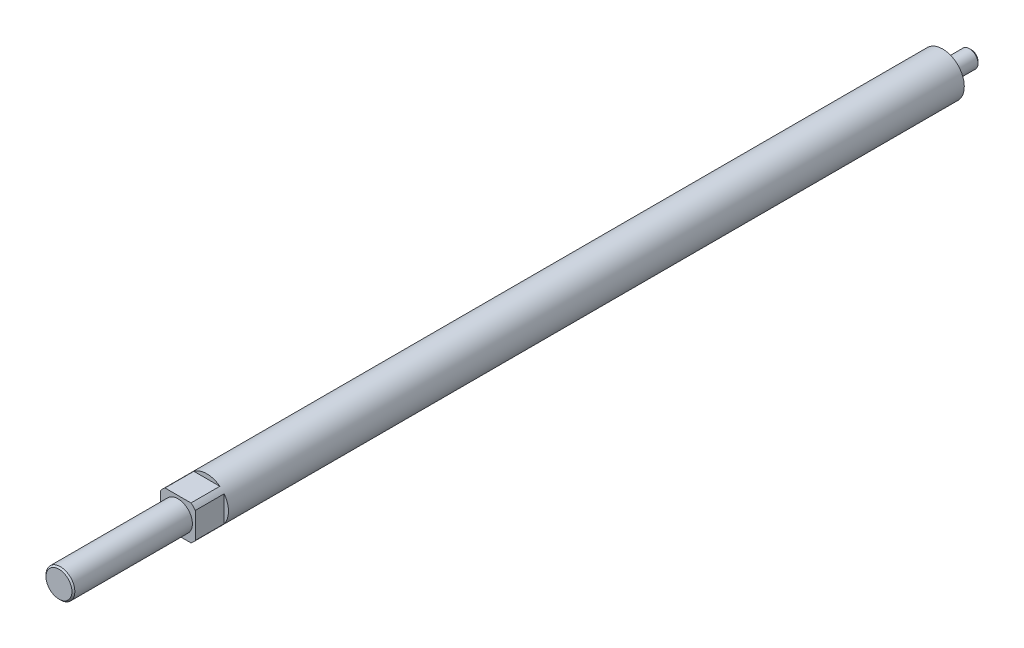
ISO-10303-21;
HEADER;
FILE_DESCRIPTION(('STEP AP214'),'2;1');
FILE_NAME('part.step','',(''),(''),'','','');
FILE_SCHEMA(('AUTOMOTIVE_DESIGN { 1 0 10303 214 1 1 1 1 }'));
ENDSEC;
DATA;
#1=APPLICATION_CONTEXT('core data for automotive mechanical design processes');
#2=APPLICATION_PROTOCOL_DEFINITION('international standard','automotive_design',2000,#1);
#3=PRODUCT_CONTEXT('',#1,'mechanical');
#4=PRODUCT('Part','Part','',(#3));
#5=PRODUCT_RELATED_PRODUCT_CATEGORY('part','',(#4));
#6=PRODUCT_DEFINITION_FORMATION('','',#4);
#7=PRODUCT_DEFINITION_CONTEXT('part definition',#1,'design');
#8=PRODUCT_DEFINITION('design','',#6,#7);
#9=PRODUCT_DEFINITION_SHAPE('','',#8);
#10=(LENGTH_UNIT() NAMED_UNIT(*) SI_UNIT(.MILLI.,.METRE.));
#11=(NAMED_UNIT(*) PLANE_ANGLE_UNIT() SI_UNIT($,.RADIAN.));
#12=(NAMED_UNIT(*) SI_UNIT($,.STERADIAN.) SOLID_ANGLE_UNIT());
#13=UNCERTAINTY_MEASURE_WITH_UNIT(LENGTH_MEASURE(1.E-05),#10,'distance_accuracy_value','');
#14=(GEOMETRIC_REPRESENTATION_CONTEXT(3) GLOBAL_UNCERTAINTY_ASSIGNED_CONTEXT((#13)) GLOBAL_UNIT_ASSIGNED_CONTEXT((#10,
#11,#12)) REPRESENTATION_CONTEXT('',''));
#15=CARTESIAN_POINT('',(0.,0.,0.));
#16=DIRECTION('',(0.,0.,1.));
#17=DIRECTION('',(1.,0.,0.));
#18=AXIS2_PLACEMENT_3D('',#15,#16,#17);
#19=CARTESIAN_POINT('',(0.,5.,-177.));
#20=DIRECTION('',(0.,0.,1.));
#21=DIRECTION('',(1.,0.,0.));
#22=AXIS2_PLACEMENT_3D('',#19,#20,#21);
#23=PLANE('',#22);
#24=CARTESIAN_POINT('',(0.,0.,-177.));
#25=DIRECTION('',(0.,0.,1.));
#26=DIRECTION('',(1.,0.,0.));
#27=AXIS2_PLACEMENT_3D('',#24,#25,#26);
#28=CIRCLE('',#27,15.0000000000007);
#29=CARTESIAN_POINT('',(15.0000000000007,0.,-177.));
#30=VERTEX_POINT('',#29);
#31=EDGE_CURVE('E176',#30,#30,#28,.T.);
#32=ORIENTED_EDGE('',*,*,#31,.F.);
#33=EDGE_LOOP('',(#32));
#34=FACE_BOUND('',#33,.T.);
#35=CARTESIAN_POINT('',(0.,0.,-177.));
#36=DIRECTION('',(0.,0.,1.));
#37=DIRECTION('',(1.,0.,0.));
#38=AXIS2_PLACEMENT_3D('',#35,#36,#37);
#39=CIRCLE('',#38,5.);
#40=CARTESIAN_POINT('',(5.,0.,-177.));
#41=VERTEX_POINT('',#40);
#42=EDGE_CURVE('E382',#41,#41,#39,.T.);
#43=ORIENTED_EDGE('',*,*,#42,.T.);
#44=EDGE_LOOP('',(#43));
#45=FACE_BOUND('',#44,.T.);
#46=ADVANCED_FACE('F35',(#34,#45),#23,.F.);
#47=CARTESIAN_POINT('',(0.,0.,-135.));
#48=DIRECTION('',(0.,0.,1.));
#49=DIRECTION('',(1.,0.,0.));
#50=AXIS2_PLACEMENT_3D('',#47,#48,#49);
#51=CYLINDRICAL_SURFACE('',#50,5.);
#52=ORIENTED_EDGE('',*,*,#42,.F.);
#53=EDGE_LOOP('',(#52));
#54=FACE_BOUND('',#53,.T.);
#55=CARTESIAN_POINT('',(0.,0.,-180.));
#56=DIRECTION('',(0.,0.,1.));
#57=DIRECTION('',(1.,0.,0.));
#58=AXIS2_PLACEMENT_3D('',#55,#56,#57);
#59=CIRCLE('',#58,5.);
#60=CARTESIAN_POINT('',(5.,0.,-180.));
#61=VERTEX_POINT('',#60);
#62=EDGE_CURVE('E379',#61,#61,#59,.T.);
#63=ORIENTED_EDGE('',*,*,#62,.T.);
#64=EDGE_LOOP('',(#63));
#65=FACE_BOUND('',#64,.T.);
#66=ADVANCED_FACE('F197',(#54,#65),#51,.T.);
#67=CARTESIAN_POINT('',(0.,5.,-180.));
#68=DIRECTION('',(0.,0.,-1.));
#69=DIRECTION('',(-1.,0.,0.));
#70=AXIS2_PLACEMENT_3D('',#67,#68,#69);
#71=PLANE('',#70);
#72=ORIENTED_EDGE('',*,*,#62,.F.);
#73=EDGE_LOOP('',(#72));
#74=FACE_BOUND('',#73,.T.);
#75=CARTESIAN_POINT('',(0.,0.,-180.));
#76=DIRECTION('',(0.,0.,1.));
#77=DIRECTION('',(1.,0.,0.));
#78=AXIS2_PLACEMENT_3D('',#75,#76,#77);
#79=CIRCLE('',#78,6.);
#80=CARTESIAN_POINT('',(6.,0.,-180.));
#81=VERTEX_POINT('',#80);
#82=EDGE_CURVE('E374',#81,#81,#79,.T.);
#83=ORIENTED_EDGE('',*,*,#82,.T.);
#84=EDGE_LOOP('',(#83));
#85=FACE_BOUND('',#84,.T.);
#86=ADVANCED_FACE('F203',(#74,#85),#71,.F.);
#87=CARTESIAN_POINT('',(0.,0.,-135.));
#88=DIRECTION('',(0.,0.,1.));
#89=DIRECTION('',(1.,0.,0.));
#90=AXIS2_PLACEMENT_3D('',#87,#88,#89);
#91=CYLINDRICAL_SURFACE('',#90,6.);
#92=ORIENTED_EDGE('',*,*,#82,.F.);
#93=EDGE_LOOP('',(#92));
#94=FACE_BOUND('',#93,.T.);
#95=CARTESIAN_POINT('',(0.,0.,-195.5));
#96=DIRECTION('',(0.,0.,1.));
#97=DIRECTION('',(1.,0.,0.));
#98=AXIS2_PLACEMENT_3D('',#95,#96,#97);
#99=CIRCLE('',#98,6.);
#100=CARTESIAN_POINT('',(6.,0.,-195.5));
#101=VERTEX_POINT('',#100);
#102=EDGE_CURVE('E371',#101,#101,#99,.T.);
#103=ORIENTED_EDGE('',*,*,#102,.T.);
#104=EDGE_LOOP('',(#103));
#105=FACE_BOUND('',#104,.T.);
#106=ADVANCED_FACE('F334',(#94,#105),#91,.T.);
#107=CARTESIAN_POINT('',(0.,0.,-197.));
#108=DIRECTION('',(0.,0.,1.));
#109=DIRECTION('',(1.,0.,0.));
#110=AXIS2_PLACEMENT_3D('',#107,#108,#109);
#111=CONICAL_SURFACE('',#110,4.49999999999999,0.785398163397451);
#112=ORIENTED_EDGE('',*,*,#102,.F.);
#113=EDGE_LOOP('',(#112));
#114=FACE_BOUND('',#113,.T.);
#115=CARTESIAN_POINT('',(0.,0.,-197.));
#116=DIRECTION('',(0.,0.,1.));
#117=DIRECTION('',(1.,0.,0.));
#118=AXIS2_PLACEMENT_3D('',#115,#116,#117);
#119=CIRCLE('',#118,4.49999999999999);
#120=CARTESIAN_POINT('',(4.49999999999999,0.,-197.));
#121=VERTEX_POINT('',#120);
#122=EDGE_CURVE('E369',#121,#121,#119,.T.);
#123=ORIENTED_EDGE('',*,*,#122,.T.);
#124=EDGE_LOOP('',(#123));
#125=FACE_BOUND('',#124,.T.);
#126=ADVANCED_FACE('F342',(#114,#125),#111,.T.);
#127=CARTESIAN_POINT('',(0.,4.49999999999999,-197.));
#128=DIRECTION('',(0.,0.,1.));
#129=DIRECTION('',(1.,0.,0.));
#130=AXIS2_PLACEMENT_3D('',#127,#128,#129);
#131=PLANE('',#130);
#132=ORIENTED_EDGE('',*,*,#122,.F.);
#133=EDGE_LOOP('',(#132));
#134=FACE_BOUND('',#133,.T.);
#135=ADVANCED_FACE('F274',(#134),#131,.F.);
#136=CARTESIAN_POINT('',(0.,0.,353.));
#137=DIRECTION('',(0.,0.,1.));
#138=DIRECTION('',(1.,0.,0.));
#139=AXIS2_PLACEMENT_3D('',#136,#137,#138);
#140=PLANE('',#139);
#141=DIRECTION('',(0.,-1.,0.));
#142=VECTOR('',#141,1.);
#143=CARTESIAN_POINT('',(12.,12.,353.));
#144=LINE('',#143,#142);
#145=CARTESIAN_POINT('',(12.,9.00000000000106,353.));
#146=VERTEX_POINT('',#145);
#147=CARTESIAN_POINT('',(12.,-9.00000000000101,353.));
#148=VERTEX_POINT('',#147);
#149=EDGE_CURVE('E50',#146,#148,#144,.T.);
#150=ORIENTED_EDGE('',*,*,#149,.F.);
#151=CARTESIAN_POINT('',(0.,0.,353.));
#152=DIRECTION('',(0.,0.,1.));
#153=DIRECTION('',(1.,0.,0.));
#154=AXIS2_PLACEMENT_3D('',#151,#152,#153);
#155=CIRCLE('',#154,15.0000000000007);
#156=CARTESIAN_POINT('',(9.00000000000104,12.,353.));
#157=VERTEX_POINT('',#156);
#158=EDGE_CURVE('E121',#146,#157,#155,.T.);
#159=ORIENTED_EDGE('',*,*,#158,.T.);
#160=DIRECTION('',(1.,0.,0.));
#161=VECTOR('',#160,1.);
#162=CARTESIAN_POINT('',(12.,12.,353.));
#163=LINE('',#162,#161);
#164=CARTESIAN_POINT('',(-9.00000000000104,12.,353.));
#165=VERTEX_POINT('',#164);
#166=EDGE_CURVE('E103',#165,#157,#163,.T.);
#167=ORIENTED_EDGE('',*,*,#166,.F.);
#168=CARTESIAN_POINT('',(-12.,9.00000000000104,353.));
#169=VERTEX_POINT('',#168);
#170=EDGE_CURVE('E119',#165,#169,#155,.T.);
#171=ORIENTED_EDGE('',*,*,#170,.T.);
#172=DIRECTION('',(0.,1.,0.));
#173=VECTOR('',#172,1.);
#174=CARTESIAN_POINT('',(-12.,12.,353.));
#175=LINE('',#174,#173);
#176=CARTESIAN_POINT('',(-12.,-9.00000000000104,353.));
#177=VERTEX_POINT('',#176);
#178=EDGE_CURVE('E123',#177,#169,#175,.T.);
#179=ORIENTED_EDGE('',*,*,#178,.F.);
#180=CARTESIAN_POINT('',(-9.00000000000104,-12.,353.));
#181=VERTEX_POINT('',#180);
#182=EDGE_CURVE('E129',#177,#181,#155,.T.);
#183=ORIENTED_EDGE('',*,*,#182,.T.);
#184=DIRECTION('',(-1.,0.,0.));
#185=VECTOR('',#184,1.);
#186=CARTESIAN_POINT('',(12.,-12.,353.));
#187=LINE('',#186,#185);
#188=CARTESIAN_POINT('',(9.00000000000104,-12.,353.));
#189=VERTEX_POINT('',#188);
#190=EDGE_CURVE('E58',#189,#181,#187,.T.);
#191=ORIENTED_EDGE('',*,*,#190,.F.);
#192=EDGE_CURVE('E132',#189,#148,#155,.T.);
#193=ORIENTED_EDGE('',*,*,#192,.T.);
#194=EDGE_LOOP('',(#150,#159,#167,#171,#179,#183,#191,#193));
#195=FACE_BOUND('',#194,.T.);
#196=CARTESIAN_POINT('',(0.,0.,353.));
#197=DIRECTION('',(0.,0.,1.));
#198=DIRECTION('',(1.,0.,0.));
#199=AXIS2_PLACEMENT_3D('',#196,#197,#198);
#200=CIRCLE('',#199,10.);
#201=CARTESIAN_POINT('',(10.,0.,353.));
#202=VERTEX_POINT('',#201);
#203=EDGE_CURVE('E136',#202,#202,#200,.T.);
#204=ORIENTED_EDGE('',*,*,#203,.F.);
#205=EDGE_LOOP('',(#204));
#206=FACE_BOUND('',#205,.T.);
#207=ADVANCED_FACE('F116',(#195,#206),#140,.T.);
#208=CARTESIAN_POINT('',(0.,0.,353.));
#209=DIRECTION('',(0.,0.,-1.));
#210=DIRECTION('',(-1.,0.,0.));
#211=AXIS2_PLACEMENT_3D('',#208,#209,#210);
#212=CYLINDRICAL_SURFACE('',#211,15.0000000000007);
#213=ORIENTED_EDGE('',*,*,#158,.F.);
#214=DIRECTION('',(0.,0.,-1.));
#215=VECTOR('',#214,1.);
#216=CARTESIAN_POINT('',(12.,9.00000000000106,353.));
#217=LINE('',#216,#215);
#218=CARTESIAN_POINT('',(12.,9.00000000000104,333.));
#219=VERTEX_POINT('',#218);
#220=EDGE_CURVE('E11',#146,#219,#217,.T.);
#221=ORIENTED_EDGE('',*,*,#220,.T.);
#222=CARTESIAN_POINT('',(0.,0.,333.));
#223=DIRECTION('',(0.,0.,-1.));
#224=DIRECTION('',(-1.,0.,0.));
#225=AXIS2_PLACEMENT_3D('',#222,#223,#224);
#226=CIRCLE('',#225,15.0000000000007);
#227=CARTESIAN_POINT('',(12.,-9.00000000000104,333.));
#228=VERTEX_POINT('',#227);
#229=EDGE_CURVE('E43',#219,#228,#226,.T.);
#230=ORIENTED_EDGE('',*,*,#229,.T.);
#231=DIRECTION('',(0.,0.,-1.));
#232=VECTOR('',#231,1.);
#233=CARTESIAN_POINT('',(12.,-9.00000000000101,353.));
#234=LINE('',#233,#232);
#235=EDGE_CURVE('E155',#228,#148,#234,.F.);
#236=ORIENTED_EDGE('',*,*,#235,.T.);
#237=ORIENTED_EDGE('',*,*,#192,.F.);
#238=DIRECTION('',(0.,0.,-1.));
#239=VECTOR('',#238,1.);
#240=CARTESIAN_POINT('',(9.00000000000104,-12.,353.));
#241=LINE('',#240,#239);
#242=CARTESIAN_POINT('',(9.00000000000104,-12.,333.));
#243=VERTEX_POINT('',#242);
#244=EDGE_CURVE('E153',#189,#243,#241,.T.);
#245=ORIENTED_EDGE('',*,*,#244,.T.);
#246=CARTESIAN_POINT('',(-9.00000000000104,-12.,333.));
#247=VERTEX_POINT('',#246);
#248=EDGE_CURVE('E152',#243,#247,#226,.T.);
#249=ORIENTED_EDGE('',*,*,#248,.T.);
#250=DIRECTION('',(0.,0.,-1.));
#251=VECTOR('',#250,1.);
#252=CARTESIAN_POINT('',(-9.00000000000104,-12.,353.));
#253=LINE('',#252,#251);
#254=EDGE_CURVE('E150',#247,#181,#253,.F.);
#255=ORIENTED_EDGE('',*,*,#254,.T.);
#256=ORIENTED_EDGE('',*,*,#182,.F.);
#257=DIRECTION('',(0.,0.,-1.));
#258=VECTOR('',#257,1.);
#259=CARTESIAN_POINT('',(-12.,-9.00000000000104,353.));
#260=LINE('',#259,#258);
#261=CARTESIAN_POINT('',(-12.,-9.00000000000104,333.));
#262=VERTEX_POINT('',#261);
#263=EDGE_CURVE('E147',#177,#262,#260,.T.);
#264=ORIENTED_EDGE('',*,*,#263,.T.);
#265=CARTESIAN_POINT('',(-12.,9.00000000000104,333.));
#266=VERTEX_POINT('',#265);
#267=EDGE_CURVE('E144',#262,#266,#226,.T.);
#268=ORIENTED_EDGE('',*,*,#267,.T.);
#269=DIRECTION('',(0.,0.,-1.));
#270=VECTOR('',#269,1.);
#271=CARTESIAN_POINT('',(-12.,9.00000000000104,353.));
#272=LINE('',#271,#270);
#273=EDGE_CURVE('E110',#266,#169,#272,.F.);
#274=ORIENTED_EDGE('',*,*,#273,.T.);
#275=ORIENTED_EDGE('',*,*,#170,.F.);
#276=DIRECTION('',(0.,0.,-1.));
#277=VECTOR('',#276,1.);
#278=CARTESIAN_POINT('',(-9.00000000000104,12.,353.));
#279=LINE('',#278,#277);
#280=CARTESIAN_POINT('',(-9.00000000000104,12.,333.));
#281=VERTEX_POINT('',#280);
#282=EDGE_CURVE('E100',#165,#281,#279,.T.);
#283=ORIENTED_EDGE('',*,*,#282,.T.);
#284=CARTESIAN_POINT('',(9.00000000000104,12.,333.));
#285=VERTEX_POINT('',#284);
#286=EDGE_CURVE('E111',#281,#285,#226,.T.);
#287=ORIENTED_EDGE('',*,*,#286,.T.);
#288=DIRECTION('',(0.,0.,-1.));
#289=VECTOR('',#288,1.);
#290=CARTESIAN_POINT('',(9.00000000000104,12.,353.));
#291=LINE('',#290,#289);
#292=EDGE_CURVE('E142',#285,#157,#291,.F.);
#293=ORIENTED_EDGE('',*,*,#292,.T.);
#294=EDGE_LOOP('',(#213,#221,#230,#236,#237,#245,#249,#255,#256,#264,#268,#274,#275,#283,#287,#293));
#295=FACE_BOUND('',#294,.T.);
#296=ORIENTED_EDGE('',*,*,#31,.T.);
#297=EDGE_LOOP('',(#296));
#298=FACE_BOUND('',#297,.T.);
#299=ADVANCED_FACE('F126',(#295,#298),#212,.T.);
#300=CARTESIAN_POINT('',(0.,0.,435.5));
#301=DIRECTION('',(0.,0.,-1.));
#302=DIRECTION('',(-1.,0.,0.));
#303=AXIS2_PLACEMENT_3D('',#300,#301,#302);
#304=CYLINDRICAL_SURFACE('',#303,10.);
#305=CARTESIAN_POINT('',(0.,0.,434.5));
#306=DIRECTION('',(0.,0.,1.));
#307=DIRECTION('',(1.,0.,0.));
#308=AXIS2_PLACEMENT_3D('',#305,#306,#307);
#309=CIRCLE('',#308,10.);
#310=CARTESIAN_POINT('',(10.,0.,434.5));
#311=VERTEX_POINT('',#310);
#312=EDGE_CURVE('E139',#311,#311,#309,.F.);
#313=ORIENTED_EDGE('',*,*,#312,.T.);
#314=EDGE_LOOP('',(#313));
#315=FACE_BOUND('',#314,.T.);
#316=ORIENTED_EDGE('',*,*,#203,.T.);
#317=EDGE_LOOP('',(#316));
#318=FACE_BOUND('',#317,.T.);
#319=ADVANCED_FACE('F289',(#315,#318),#304,.T.);
#320=CARTESIAN_POINT('',(0.,0.,435.5));
#321=DIRECTION('',(0.,0.,1.));
#322=DIRECTION('',(1.,0.,0.));
#323=AXIS2_PLACEMENT_3D('',#320,#321,#322);
#324=PLANE('',#323);
#325=CARTESIAN_POINT('',(0.,0.,435.5));
#326=DIRECTION('',(0.,0.,1.));
#327=DIRECTION('',(1.,0.,0.));
#328=AXIS2_PLACEMENT_3D('',#325,#326,#327);
#329=CIRCLE('',#328,9.);
#330=CARTESIAN_POINT('',(9.,0.,435.5));
#331=VERTEX_POINT('',#330);
#332=EDGE_CURVE('E131',#331,#331,#329,.T.);
#333=ORIENTED_EDGE('',*,*,#332,.T.);
#334=EDGE_LOOP('',(#333));
#335=FACE_BOUND('',#334,.T.);
#336=ADVANCED_FACE('F295',(#335),#324,.T.);
#337=CARTESIAN_POINT('',(0.,0.,435.5));
#338=DIRECTION('',(0.,0.,-1.));
#339=DIRECTION('',(-1.,0.,0.));
#340=AXIS2_PLACEMENT_3D('',#337,#338,#339);
#341=CONICAL_SURFACE('',#340,9.,0.785398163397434);
#342=ORIENTED_EDGE('',*,*,#312,.F.);
#343=EDGE_LOOP('',(#342));
#344=FACE_BOUND('',#343,.T.);
#345=ORIENTED_EDGE('',*,*,#332,.F.);
#346=EDGE_LOOP('',(#345));
#347=FACE_BOUND('',#346,.T.);
#348=ADVANCED_FACE('F37',(#344,#347),#341,.T.);
#349=CARTESIAN_POINT('',(12.,12.,333.));
#350=DIRECTION('',(0.,-1.,0.));
#351=DIRECTION('',(0.,0.,-1.));
#352=AXIS2_PLACEMENT_3D('',#349,#350,#351);
#353=PLANE('',#352);
#354=ORIENTED_EDGE('',*,*,#166,.T.);
#355=ORIENTED_EDGE('',*,*,#292,.F.);
#356=DIRECTION('',(1.,0.,0.));
#357=VECTOR('',#356,1.);
#358=CARTESIAN_POINT('',(12.,12.,333.));
#359=LINE('',#358,#357);
#360=EDGE_CURVE('E106',#281,#285,#359,.T.);
#361=ORIENTED_EDGE('',*,*,#360,.F.);
#362=ORIENTED_EDGE('',*,*,#282,.F.);
#363=EDGE_LOOP('',(#354,#355,#361,#362));
#364=FACE_BOUND('',#363,.T.);
#365=ADVANCED_FACE('F102',(#364),#353,.F.);
#366=CARTESIAN_POINT('',(0.,0.,333.));
#367=DIRECTION('',(0.,0.,-1.));
#368=DIRECTION('',(-1.,0.,0.));
#369=AXIS2_PLACEMENT_3D('',#366,#367,#368);
#370=PLANE('',#369);
#371=ORIENTED_EDGE('',*,*,#360,.T.);
#372=ORIENTED_EDGE('',*,*,#286,.F.);
#373=EDGE_LOOP('',(#371,#372));
#374=FACE_BOUND('',#373,.T.);
#375=ADVANCED_FACE('F191',(#374),#370,.F.);
#376=CARTESIAN_POINT('',(-12.,12.,333.));
#377=DIRECTION('',(1.,0.,0.));
#378=DIRECTION('',(0.,0.,-1.));
#379=AXIS2_PLACEMENT_3D('',#376,#377,#378);
#380=PLANE('',#379);
#381=ORIENTED_EDGE('',*,*,#178,.T.);
#382=ORIENTED_EDGE('',*,*,#273,.F.);
#383=DIRECTION('',(0.,1.,0.));
#384=VECTOR('',#383,1.);
#385=CARTESIAN_POINT('',(-12.,12.,333.));
#386=LINE('',#385,#384);
#387=EDGE_CURVE('E165',#262,#266,#386,.T.);
#388=ORIENTED_EDGE('',*,*,#387,.F.);
#389=ORIENTED_EDGE('',*,*,#263,.F.);
#390=EDGE_LOOP('',(#381,#382,#388,#389));
#391=FACE_BOUND('',#390,.T.);
#392=ADVANCED_FACE('F167',(#391),#380,.F.);
#393=ORIENTED_EDGE('',*,*,#387,.T.);
#394=ORIENTED_EDGE('',*,*,#267,.F.);
#395=EDGE_LOOP('',(#393,#394));
#396=FACE_BOUND('',#395,.T.);
#397=ADVANCED_FACE('F164',(#396),#370,.F.);
#398=CARTESIAN_POINT('',(12.,-12.,333.));
#399=DIRECTION('',(0.,1.,0.));
#400=DIRECTION('',(0.,0.,1.));
#401=AXIS2_PLACEMENT_3D('',#398,#399,#400);
#402=PLANE('',#401);
#403=ORIENTED_EDGE('',*,*,#190,.T.);
#404=ORIENTED_EDGE('',*,*,#254,.F.);
#405=DIRECTION('',(-1.,0.,0.));
#406=VECTOR('',#405,1.);
#407=CARTESIAN_POINT('',(12.,-12.,333.));
#408=LINE('',#407,#406);
#409=EDGE_CURVE('E168',#243,#247,#408,.T.);
#410=ORIENTED_EDGE('',*,*,#409,.F.);
#411=ORIENTED_EDGE('',*,*,#244,.F.);
#412=EDGE_LOOP('',(#403,#404,#410,#411));
#413=FACE_BOUND('',#412,.T.);
#414=ADVANCED_FACE('F179',(#413),#402,.F.);
#415=ORIENTED_EDGE('',*,*,#409,.T.);
#416=ORIENTED_EDGE('',*,*,#248,.F.);
#417=EDGE_LOOP('',(#415,#416));
#418=FACE_BOUND('',#417,.T.);
#419=ADVANCED_FACE('F181',(#418),#370,.F.);
#420=DIRECTION('',(0.,-1.,0.));
#421=VECTOR('',#420,1.);
#422=CARTESIAN_POINT('',(12.,12.,333.));
#423=LINE('',#422,#421);
#424=EDGE_CURVE('E122',#219,#228,#423,.T.);
#425=ORIENTED_EDGE('',*,*,#424,.T.);
#426=ORIENTED_EDGE('',*,*,#229,.F.);
#427=EDGE_LOOP('',(#425,#426));
#428=FACE_BOUND('',#427,.T.);
#429=ADVANCED_FACE('F183',(#428),#370,.F.);
#430=CARTESIAN_POINT('',(12.,12.,333.));
#431=DIRECTION('',(-1.,0.,0.));
#432=DIRECTION('',(0.,0.,1.));
#433=AXIS2_PLACEMENT_3D('',#430,#431,#432);
#434=PLANE('',#433);
#435=ORIENTED_EDGE('',*,*,#149,.T.);
#436=ORIENTED_EDGE('',*,*,#235,.F.);
#437=ORIENTED_EDGE('',*,*,#424,.F.);
#438=ORIENTED_EDGE('',*,*,#220,.F.);
#439=EDGE_LOOP('',(#435,#436,#437,#438));
#440=FACE_BOUND('',#439,.T.);
#441=ADVANCED_FACE('F189',(#440),#434,.F.);
#442=CLOSED_SHELL('',(#46,#66,#86,#106,#126,#135,#207,#299,#319,#336,#348,#365,#375,#392,#397,
#414,#419,#429,#441));
#443=MANIFOLD_SOLID_BREP('B2',#442);
#444=ADVANCED_BREP_SHAPE_REPRESENTATION('',(#18,#443),#14);
#445=SHAPE_DEFINITION_REPRESENTATION(#9,#444);
ENDSEC;
END-ISO-10303-21;
